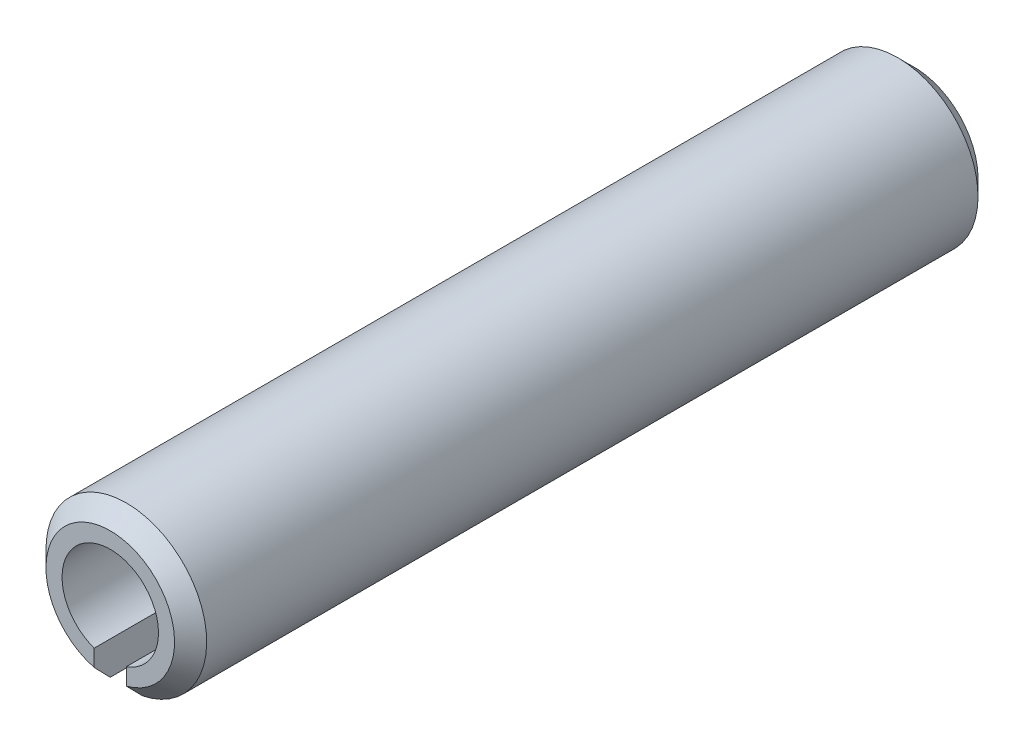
ISO-10303-21;
HEADER;
FILE_DESCRIPTION(('STEP AP214'),'2;1');
FILE_NAME('part.step','',(''),(''),'','','');
FILE_SCHEMA(('AUTOMOTIVE_DESIGN { 1 0 10303 214 1 1 1 1 }'));
ENDSEC;
DATA;
#1=APPLICATION_CONTEXT('core data for automotive mechanical design processes');
#2=APPLICATION_PROTOCOL_DEFINITION('international standard','automotive_design',2000,#1);
#3=PRODUCT_CONTEXT('',#1,'mechanical');
#4=PRODUCT('Part','Part','',(#3));
#5=PRODUCT_RELATED_PRODUCT_CATEGORY('part','',(#4));
#6=PRODUCT_DEFINITION_FORMATION('','',#4);
#7=PRODUCT_DEFINITION_CONTEXT('part definition',#1,'design');
#8=PRODUCT_DEFINITION('design','',#6,#7);
#9=PRODUCT_DEFINITION_SHAPE('','',#8);
#10=(LENGTH_UNIT() NAMED_UNIT(*) SI_UNIT(.MILLI.,.METRE.));
#11=(NAMED_UNIT(*) PLANE_ANGLE_UNIT() SI_UNIT($,.RADIAN.));
#12=(NAMED_UNIT(*) SI_UNIT($,.STERADIAN.) SOLID_ANGLE_UNIT());
#13=UNCERTAINTY_MEASURE_WITH_UNIT(LENGTH_MEASURE(1.E-05),#10,'distance_accuracy_value','');
#14=(GEOMETRIC_REPRESENTATION_CONTEXT(3) GLOBAL_UNCERTAINTY_ASSIGNED_CONTEXT((#13)) GLOBAL_UNIT_ASSIGNED_CONTEXT((#10,
#11,#12)) REPRESENTATION_CONTEXT('',''));
#15=CARTESIAN_POINT('',(0.,0.,0.));
#16=DIRECTION('',(0.,0.,1.));
#17=DIRECTION('',(1.,0.,0.));
#18=AXIS2_PLACEMENT_3D('',#15,#16,#17);
#19=CARTESIAN_POINT('',(0.,0.,-50.));
#20=DIRECTION('',(0.,0.,1.));
#21=DIRECTION('',(1.,0.,0.));
#22=AXIS2_PLACEMENT_3D('',#19,#20,#21);
#23=CYLINDRICAL_SURFACE('',#22,5.);
#24=DIRECTION('',(0.,0.,1.));
#25=VECTOR('',#24,1.);
#26=CARTESIAN_POINT('',(1.,-4.89897948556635,-50.));
#27=LINE('',#26,#25);
#28=CARTESIAN_POINT('',(1.,-4.89897948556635,-49.));
#29=VERTEX_POINT('',#28);
#30=CARTESIAN_POINT('',(1.,-4.89897948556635,-1.));
#31=VERTEX_POINT('',#30);
#32=EDGE_CURVE('E439',#29,#31,#27,.T.);
#33=ORIENTED_EDGE('',*,*,#32,.F.);
#34=CARTESIAN_POINT('',(0.,0.,-49.));
#35=DIRECTION('',(0.,0.,1.));
#36=DIRECTION('',(1.,0.,0.));
#37=AXIS2_PLACEMENT_3D('',#34,#35,#36);
#38=CIRCLE('',#37,5.);
#39=CARTESIAN_POINT('',(-0.999999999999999,-4.89897948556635,-49.));
#40=VERTEX_POINT('',#39);
#41=EDGE_CURVE('E446',#29,#40,#38,.T.);
#42=ORIENTED_EDGE('',*,*,#41,.T.);
#43=DIRECTION('',(0.,0.,1.));
#44=VECTOR('',#43,1.);
#45=CARTESIAN_POINT('',(-0.999999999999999,-4.89897948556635,-50.));
#46=LINE('',#45,#44);
#47=CARTESIAN_POINT('',(-0.999999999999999,-4.89897948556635,-1.));
#48=VERTEX_POINT('',#47);
#49=EDGE_CURVE('E427',#40,#48,#46,.T.);
#50=ORIENTED_EDGE('',*,*,#49,.T.);
#51=CARTESIAN_POINT('',(0.,0.,-1.));
#52=DIRECTION('',(0.,0.,1.));
#53=DIRECTION('',(1.,0.,0.));
#54=AXIS2_PLACEMENT_3D('',#51,#52,#53);
#55=CIRCLE('',#54,5.);
#56=EDGE_CURVE('E441',#48,#31,#55,.F.);
#57=ORIENTED_EDGE('',*,*,#56,.T.);
#58=EDGE_LOOP('',(#33,#42,#50,#57));
#59=FACE_BOUND('',#58,.T.);
#60=ADVANCED_FACE('F354',(#59),#23,.T.);
#61=CARTESIAN_POINT('',(1.,-2.82842712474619,-50.));
#62=DIRECTION('',(-1.,0.,0.));
#63=DIRECTION('',(0.,-1.,0.));
#64=AXIS2_PLACEMENT_3D('',#61,#62,#63);
#65=PLANE('',#64);
#66=DIRECTION('',(0.,-1.,0.));
#67=VECTOR('',#66,1.);
#68=CARTESIAN_POINT('',(1.,-2.82842712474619,-50.));
#69=LINE('',#68,#67);
#70=CARTESIAN_POINT('',(1.,-2.82842712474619,-50.));
#71=VERTEX_POINT('',#70);
#72=CARTESIAN_POINT('',(1.,-3.87298334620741,-50.));
#73=VERTEX_POINT('',#72);
#74=EDGE_CURVE('E437',#71,#73,#69,.T.);
#75=ORIENTED_EDGE('',*,*,#74,.T.);
#76=CARTESIAN_POINT('',(1.,-3.87298334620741,-50.));
#77=CARTESIAN_POINT('',(1.,-3.95875684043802,-49.916947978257));
#78=CARTESIAN_POINT('',(1.,-4.04444634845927,-49.833809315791));
#79=CARTESIAN_POINT('',(1.,-4.21568142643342,-49.6673842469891));
#80=CARTESIAN_POINT('',(1.,-4.30122699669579,-49.5840978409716));
#81=CARTESIAN_POINT('',(1.,-4.47219854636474,-49.4174025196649));
#82=CARTESIAN_POINT('',(1.,-4.55762452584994,-49.3339936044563));
#83=CARTESIAN_POINT('',(1.,-4.72837434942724,-49.1670709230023));
#84=CARTESIAN_POINT('',(1.,-4.81369819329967,-49.0835571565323));
#85=CARTESIAN_POINT('',(1.,-4.89897948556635,-49.));
#86=B_SPLINE_CURVE_WITH_KNOTS('',3,(#76,#77,#78,#79,#80,#81,#82,#83,#84,#85),.UNSPECIFIED.,.F.,
.F.,(4,2,2,2,4),(0.,0.358179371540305,0.716357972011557,1.07453633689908,1.43271547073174),.UNSPECIFIED.);
#87=EDGE_CURVE('E361',#73,#29,#86,.T.);
#88=ORIENTED_EDGE('',*,*,#87,.T.);
#89=ORIENTED_EDGE('',*,*,#32,.T.);
#90=CARTESIAN_POINT('',(1.,-4.89897948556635,-1.));
#91=CARTESIAN_POINT('',(1.,-4.81369819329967,-0.916442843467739));
#92=CARTESIAN_POINT('',(1.,-4.72837434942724,-0.832929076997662));
#93=CARTESIAN_POINT('',(1.,-4.55762452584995,-0.66600639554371));
#94=CARTESIAN_POINT('',(1.,-4.47219854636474,-0.582597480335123));
#95=CARTESIAN_POINT('',(1.,-4.30122699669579,-0.415902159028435));
#96=CARTESIAN_POINT('',(1.,-4.21568142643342,-0.332615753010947));
#97=CARTESIAN_POINT('',(1.,-4.04444634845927,-0.166190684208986));
#98=CARTESIAN_POINT('',(1.,-3.95875684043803,-0.0830520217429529));
#99=CARTESIAN_POINT('',(1.,-3.87298334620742,0.));
#100=B_SPLINE_CURVE_WITH_KNOTS('',3,(#90,#91,#92,#93,#94,#95,#96,#97,#98,#99),.UNSPECIFIED.,.F.,
.F.,(4,2,2,2,4),(0.,0.358179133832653,0.716357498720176,1.07453609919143,1.43271547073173),.UNSPECIFIED.);
#101=CARTESIAN_POINT('',(1.,-3.87298334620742,0.));
#102=VERTEX_POINT('',#101);
#103=EDGE_CURVE('E368',#31,#102,#100,.T.);
#104=ORIENTED_EDGE('',*,*,#103,.T.);
#105=DIRECTION('',(0.,-1.,0.));
#106=VECTOR('',#105,1.);
#107=CARTESIAN_POINT('',(1.,-2.82842712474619,0.));
#108=LINE('',#107,#106);
#109=CARTESIAN_POINT('',(1.,-2.82842712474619,0.));
#110=VERTEX_POINT('',#109);
#111=EDGE_CURVE('E430',#110,#102,#108,.T.);
#112=ORIENTED_EDGE('',*,*,#111,.F.);
#113=DIRECTION('',(0.,0.,1.));
#114=VECTOR('',#113,1.);
#115=CARTESIAN_POINT('',(1.,-2.82842712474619,-50.));
#116=LINE('',#115,#114);
#117=EDGE_CURVE('E426',#71,#110,#116,.T.);
#118=ORIENTED_EDGE('',*,*,#117,.F.);
#119=EDGE_LOOP('',(#75,#88,#89,#104,#112,#118));
#120=FACE_BOUND('',#119,.T.);
#121=ADVANCED_FACE('F479',(#120),#65,.T.);
#122=CARTESIAN_POINT('',(0.,0.,-50.));
#123=DIRECTION('',(0.,0.,1.));
#124=DIRECTION('',(1.,0.,0.));
#125=AXIS2_PLACEMENT_3D('',#122,#123,#124);
#126=CYLINDRICAL_SURFACE('',#125,3.);
#127=CARTESIAN_POINT('',(0.,0.,0.));
#128=DIRECTION('',(0.,0.,-1.));
#129=DIRECTION('',(1.,0.,0.));
#130=AXIS2_PLACEMENT_3D('',#127,#128,#129);
#131=CIRCLE('',#130,3.);
#132=CARTESIAN_POINT('',(-1.,-2.82842712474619,0.));
#133=VERTEX_POINT('',#132);
#134=EDGE_CURVE('E414',#133,#110,#131,.T.);
#135=ORIENTED_EDGE('',*,*,#134,.F.);
#136=DIRECTION('',(0.,0.,1.));
#137=VECTOR('',#136,1.);
#138=CARTESIAN_POINT('',(-1.,-2.82842712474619,-50.));
#139=LINE('',#138,#137);
#140=CARTESIAN_POINT('',(-1.,-2.82842712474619,-50.));
#141=VERTEX_POINT('',#140);
#142=EDGE_CURVE('E419',#141,#133,#139,.T.);
#143=ORIENTED_EDGE('',*,*,#142,.F.);
#144=CARTESIAN_POINT('',(0.,0.,-50.));
#145=DIRECTION('',(0.,0.,-1.));
#146=DIRECTION('',(1.,0.,0.));
#147=AXIS2_PLACEMENT_3D('',#144,#145,#146);
#148=CIRCLE('',#147,3.);
#149=EDGE_CURVE('E435',#141,#71,#148,.T.);
#150=ORIENTED_EDGE('',*,*,#149,.T.);
#151=ORIENTED_EDGE('',*,*,#117,.T.);
#152=EDGE_LOOP('',(#135,#143,#150,#151));
#153=FACE_BOUND('',#152,.T.);
#154=ADVANCED_FACE('F429',(#153),#126,.F.);
#155=CARTESIAN_POINT('',(-0.999999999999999,-2.82842712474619,-50.));
#156=DIRECTION('',(1.,0.,0.));
#157=DIRECTION('',(0.,1.,0.));
#158=AXIS2_PLACEMENT_3D('',#155,#156,#157);
#159=PLANE('',#158);
#160=ORIENTED_EDGE('',*,*,#49,.F.);
#161=CARTESIAN_POINT('',(-0.999999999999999,-4.89897948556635,-49.));
#162=CARTESIAN_POINT('',(-0.999999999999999,-4.81369819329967,-49.0835571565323));
#163=CARTESIAN_POINT('',(-0.999999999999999,-4.72837434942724,-49.1670709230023));
#164=CARTESIAN_POINT('',(-0.999999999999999,-4.55762452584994,-49.3339936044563));
#165=CARTESIAN_POINT('',(-0.999999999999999,-4.47219854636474,-49.4174025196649));
#166=CARTESIAN_POINT('',(-0.999999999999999,-4.30122699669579,-49.5840978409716));
#167=CARTESIAN_POINT('',(-0.999999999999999,-4.21568142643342,-49.6673842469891));
#168=CARTESIAN_POINT('',(-0.999999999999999,-4.04444634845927,-49.833809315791));
#169=CARTESIAN_POINT('',(-0.999999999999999,-3.95875684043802,-49.916947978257));
#170=CARTESIAN_POINT('',(-0.999999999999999,-3.87298334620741,-50.));
#171=B_SPLINE_CURVE_WITH_KNOTS('',3,(#161,#162,#163,#164,#165,#166,#167,#168,#169,#170),
.UNSPECIFIED.,.F.,.F.,(4,2,2,2,4),(0.,0.358179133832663,0.716357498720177,1.07453609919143,
1.43271547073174),.UNSPECIFIED.);
#172=CARTESIAN_POINT('',(-0.999999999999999,-3.87298334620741,-50.));
#173=VERTEX_POINT('',#172);
#174=EDGE_CURVE('E455',#40,#173,#171,.T.);
#175=ORIENTED_EDGE('',*,*,#174,.T.);
#176=DIRECTION('',(0.,1.,0.));
#177=VECTOR('',#176,1.);
#178=CARTESIAN_POINT('',(-0.999999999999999,-2.82842712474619,-50.));
#179=LINE('',#178,#177);
#180=EDGE_CURVE('E422',#173,#141,#179,.T.);
#181=ORIENTED_EDGE('',*,*,#180,.T.);
#182=ORIENTED_EDGE('',*,*,#142,.T.);
#183=DIRECTION('',(0.,1.,0.));
#184=VECTOR('',#183,1.);
#185=CARTESIAN_POINT('',(-0.999999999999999,-2.82842712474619,0.));
#186=LINE('',#185,#184);
#187=CARTESIAN_POINT('',(-0.999999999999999,-3.87298334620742,0.));
#188=VERTEX_POINT('',#187);
#189=EDGE_CURVE('E410',#188,#133,#186,.T.);
#190=ORIENTED_EDGE('',*,*,#189,.F.);
#191=CARTESIAN_POINT('',(-0.999999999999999,-3.87298334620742,0.));
#192=CARTESIAN_POINT('',(-0.999999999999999,-3.95875684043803,-0.0830520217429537));
#193=CARTESIAN_POINT('',(-0.999999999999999,-4.04444634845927,-0.166190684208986));
#194=CARTESIAN_POINT('',(-0.999999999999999,-4.21568142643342,-0.332615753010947));
#195=CARTESIAN_POINT('',(-0.999999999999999,-4.30122699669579,-0.415902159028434));
#196=CARTESIAN_POINT('',(-0.999999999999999,-4.47219854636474,-0.582597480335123));
#197=CARTESIAN_POINT('',(-0.999999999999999,-4.55762452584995,-0.66600639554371));
#198=CARTESIAN_POINT('',(-0.999999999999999,-4.72837434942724,-0.832929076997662));
#199=CARTESIAN_POINT('',(-0.999999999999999,-4.81369819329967,-0.916442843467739));
#200=CARTESIAN_POINT('',(-0.999999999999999,-4.89897948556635,-1.));
#201=B_SPLINE_CURVE_WITH_KNOTS('',3,(#191,#192,#193,#194,#195,#196,#197,#198,#199,#200),
.UNSPECIFIED.,.F.,.F.,(4,2,2,2,4),(0.,0.358179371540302,0.716357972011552,1.07453633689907,
1.43271547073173),.UNSPECIFIED.);
#202=EDGE_CURVE('E449',#188,#48,#201,.T.);
#203=ORIENTED_EDGE('',*,*,#202,.T.);
#204=EDGE_LOOP('',(#160,#175,#181,#182,#190,#203));
#205=FACE_BOUND('',#204,.T.);
#206=ADVANCED_FACE('F421',(#205),#159,.T.);
#207=CARTESIAN_POINT('',(0.,0.,-50.));
#208=DIRECTION('',(0.,0.,1.));
#209=DIRECTION('',(1.,0.,0.));
#210=AXIS2_PLACEMENT_3D('',#207,#208,#209);
#211=PLANE('',#210);
#212=ORIENTED_EDGE('',*,*,#180,.F.);
#213=CARTESIAN_POINT('',(0.,0.,-50.));
#214=DIRECTION('',(0.,0.,1.));
#215=DIRECTION('',(1.,0.,0.));
#216=AXIS2_PLACEMENT_3D('',#213,#214,#215);
#217=CIRCLE('',#216,3.99999999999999);
#218=EDGE_CURVE('E376',#173,#73,#217,.F.);
#219=ORIENTED_EDGE('',*,*,#218,.T.);
#220=ORIENTED_EDGE('',*,*,#74,.F.);
#221=ORIENTED_EDGE('',*,*,#149,.F.);
#222=EDGE_LOOP('',(#212,#219,#220,#221));
#223=FACE_BOUND('',#222,.T.);
#224=ADVANCED_FACE('F483',(#223),#211,.F.);
#225=CARTESIAN_POINT('',(0.,0.,0.));
#226=DIRECTION('',(0.,0.,1.));
#227=DIRECTION('',(1.,0.,0.));
#228=AXIS2_PLACEMENT_3D('',#225,#226,#227);
#229=PLANE('',#228);
#230=ORIENTED_EDGE('',*,*,#111,.T.);
#231=CARTESIAN_POINT('',(0.,0.,0.));
#232=DIRECTION('',(0.,0.,1.));
#233=DIRECTION('',(1.,0.,0.));
#234=AXIS2_PLACEMENT_3D('',#231,#232,#233);
#235=CIRCLE('',#234,4.);
#236=EDGE_CURVE('E11',#102,#188,#235,.T.);
#237=ORIENTED_EDGE('',*,*,#236,.T.);
#238=ORIENTED_EDGE('',*,*,#189,.T.);
#239=ORIENTED_EDGE('',*,*,#134,.T.);
#240=EDGE_LOOP('',(#230,#237,#238,#239));
#241=FACE_BOUND('',#240,.T.);
#242=ADVANCED_FACE('F412',(#241),#229,.T.);
#243=CARTESIAN_POINT('',(0.,0.,-49.));
#244=DIRECTION('',(0.,0.,1.));
#245=DIRECTION('',(1.,0.,0.));
#246=AXIS2_PLACEMENT_3D('',#243,#244,#245);
#247=CONICAL_SURFACE('',#246,5.,0.785398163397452);
#248=ORIENTED_EDGE('',*,*,#87,.F.);
#249=ORIENTED_EDGE('',*,*,#218,.F.);
#250=ORIENTED_EDGE('',*,*,#174,.F.);
#251=ORIENTED_EDGE('',*,*,#41,.F.);
#252=EDGE_LOOP('',(#248,#249,#250,#251));
#253=FACE_BOUND('',#252,.T.);
#254=ADVANCED_FACE('F466',(#253),#247,.T.);
#255=CARTESIAN_POINT('',(0.,0.,0.));
#256=DIRECTION('',(0.,0.,-1.));
#257=DIRECTION('',(-1.,0.,0.));
#258=AXIS2_PLACEMENT_3D('',#255,#256,#257);
#259=CONICAL_SURFACE('',#258,4.,0.785398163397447);
#260=ORIENTED_EDGE('',*,*,#103,.F.);
#261=ORIENTED_EDGE('',*,*,#56,.F.);
#262=ORIENTED_EDGE('',*,*,#202,.F.);
#263=ORIENTED_EDGE('',*,*,#236,.F.);
#264=EDGE_LOOP('',(#260,#261,#262,#263));
#265=FACE_BOUND('',#264,.T.);
#266=ADVANCED_FACE('F463',(#265),#259,.T.);
#267=CLOSED_SHELL('',(#60,#121,#154,#206,#224,#242,#254,#266));
#268=MANIFOLD_SOLID_BREP('B2',#267);
#269=ADVANCED_BREP_SHAPE_REPRESENTATION('',(#18,#268),#14);
#270=SHAPE_DEFINITION_REPRESENTATION(#9,#269);
ENDSEC;
END-ISO-10303-21;
